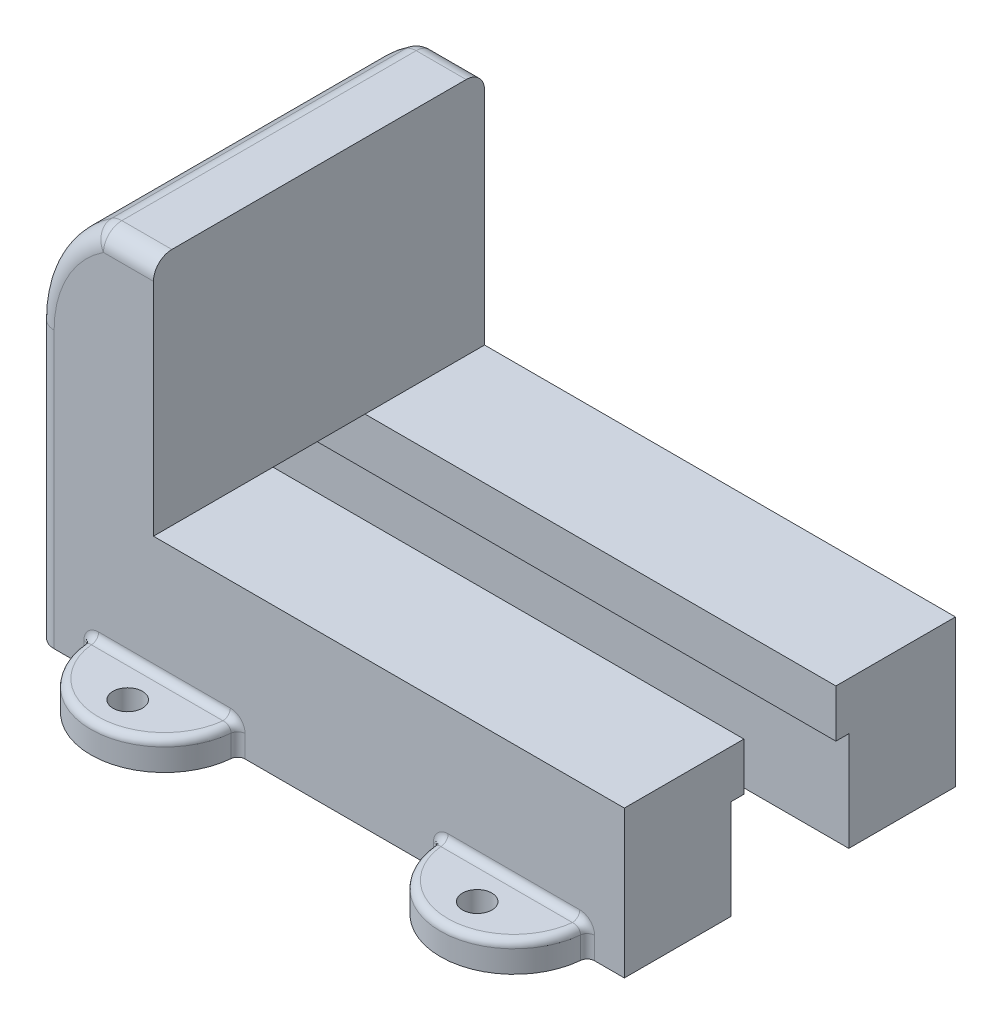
from build123d import *

# Parameters (mm, degrees)
SKETCH1_W                      = 185
SKETCH1_H                      = 40
EXTRUDE1_DEPTH                 = 45
EXTRUDE2_DEPTH                 = 90
EXTRUDE3_DEPTH                 = 25
CUT_EXTRUDE1_DEPTH             = 218.428149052
EXTRUDE4_DEPTH                 = 8
EXTRUDE5_DEPTH                 = 8
F_8_0_8_DIAMETER_HOLE1_D       = 8
F_14_0_14_DIAMETER_HOLE1_D     = 14
F_14_0_14_DIAMETER_HOLE1_DEPTH = 25
FILLET1_R                      = 2
FILLET2_R                      = 2
FILLET3_R                      = 2
FILLET10_R                     = 5
CUT_EXTRUDE2_DEPTH             = 240.478600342
CUT_EXTRUDE2_DEPTH_BACK        = 240.478600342


with BuildPart() as part:
    # Sketch1 → Extrude1 (new, symmetric)
    with BuildSketch(Plane.XY):
        with Locations((92.5, 20)):
            Rectangle(SKETCH1_W, SKETCH1_H)
    extrude(amount=EXTRUDE1_DEPTH, both=True)

    # Sketch2 → Extrude2 (add)
    with BuildSketch(Plane.XY.offset(45)):
        with BuildLine():
            Line((0, 40), (32, 40))
            Line((32, 40), (32, 105))
            Line((32, 105), (16.972243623, 105))
            ThreePointArc((16.972243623, 105), (4.537141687, 92.234101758), (0, 75))
            Line((0, 75), (0, 40))
        make_face()
    extrude(amount=-EXTRUDE2_DEPTH)

    # Sketch3 → Extrude3 (add)
    with BuildSketch(Plane(origin=(185, 0, 0), x_dir=(0, 0, -1), z_dir=(1, 0, 0))):
        with BuildLine():
            Line((-45, 40), (45, 40))
            Line((45, 40), (45, 55))
            Line((45, 55), (17, 55))
            ThreePointArc((17, 55), (0, 72), (-17, 55))
            Line((-17, 55), (-45, 55))
            Line((-45, 55), (-45, 40))
        make_face()
    extrude(amount=-EXTRUDE3_DEPTH)

    # Sketch4 → Cut-Extrude1 (cut, through all)
    with BuildSketch(Plane(origin=(185, 0, 0), x_dir=(0, 0, -1), z_dir=(1, 0, 0))):
        Polygon((-16, 0), (16, 0), (16, 27), (12.5, 27), (12.5, 40), (-12.5, 40), (-12.5, 27), (-16, 27), align=None)
    extrude(amount=-CUT_EXTRUDE1_DEPTH, mode=Mode.SUBTRACT)

    # Sketch5 → Extrude4 (add)
    with BuildSketch(Plane.XZ):
        with BuildLine():
            Line((15, 45), (55, 45))
            ThreePointArc((55, 45), (35, 65), (15, 45))
        make_face()
    extrude4 = extrude(amount=-EXTRUDE4_DEPTH)

    # Sketch6 → Extrude5 (add)
    with BuildSketch(Plane.XZ):
        with BuildLine():
            Line((110, 45), (150, 45))
            ThreePointArc((150, 45), (130, 65), (110, 45))
        make_face()
    extrude5 = extrude(amount=-EXTRUDE5_DEPTH)

    # Mirror1: Extrude4, Extrude5 across plane
    add(extrude4.mirror(Plane.XY))
    add(extrude5.mirror(Plane.XY))

    # 8.0 _8_ Diameter Hole1 (through all)
    with Locations(Plane(origin=(0, 8, 0), x_dir=(-1, 0, 0), z_dir=(0, 1, 0))):
        with Locations((-35, 55), (-130, 55), (-35, -55), (-130, -55)):
            Hole(F_8_0_8_DIAMETER_HOLE1_D / 2)

    # 14.0 _14_ Diameter Hole1
    with Locations(Plane(origin=(185, 0, 0), x_dir=(0, 0, -1), z_dir=(1, 0, 0))):
        with Locations((0, 55)):
            Hole(F_14_0_14_DIAMETER_HOLE1_D / 2, depth=F_14_0_14_DIAMETER_HOLE1_DEPTH)

    # Fillet1
    fillet1_edges = [part.edges().sort_by_distance(p)[0] for p in [
        (35, 8, -65),
        (130, 8, -65),
        (35, 8, 65),
        (130, 8, 65),
    ]]
    fillet(fillet1_edges, radius=FILLET1_R)

    # Fillet2
    fillet2_edges = [part.edges().sort_by_distance(p)[0] for p in [
        (130, 8, -45),
        (150, 3, -45),
        (110, 3, -45),
        (35, 8, -45),
        (15, 3, -45),
        (55, 3, -45),
        (150, 3, 45),
        (110, 3, 45),
        (130, 8, 45),
        (55, 3, 45),
        (15, 3, 45),
        (35, 8, 45),
        (110.585786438, 7.414213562, -45),
        (149.414213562, 7.414213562, -45),
        (15.585786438, 7.414213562, -45),
        (54.414213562, 7.414213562, -45),
        (110.585786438, 7.414213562, 45),
        (149.414213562, 7.414213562, 45),
        (15.585786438, 7.414213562, 45),
        (54.414213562, 7.414213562, 45),
        (172.5, 55, 45),
        (172.5, 55, 17),
        (172.5, 55, -17),
        (172.5, 55, -45),
    ]]
    fillet(fillet2_edges, radius=FILLET2_R)

    # Fillet3
    fillet3_edges = [part.edges().sort_by_distance(p)[0] for p in [
        (185, 26.5, 45),
        (185, 55, 30.947221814),
        (185, 55, -30.947221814),
        (185, 72, 0),
        (185, 54.414213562, -44.414213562),
        (185, 54.414213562, 44.414213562),
        (185, 55.513216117, -17.55673152),
        (185, 55.513216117, 17.55673152),
        (185, 26.5, -45),
    ]]
    fillet(fillet3_edges, radius=FILLET3_R)

    # Fillet10
    fillet10_edges = [part.edges().sort_by_distance(p)[0] for p in [
        (4.537141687, 92.234101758, -45),
        (24.486121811, 105, -45),
        (16.972243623, 105, 0),
        (24.486121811, 105, 45),
        (4.537141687, 92.234101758, 45),
        (0, 37.5, 45),
        (0, 37.5, -45),
    ]]
    fillet(fillet10_edges, radius=FILLET10_R)

    # Sketch12 → Cut-Extrude2 (cut, two sides: drawn at the far end of the back side and taken through both)
    with BuildSketch(Plane.XY.offset(45).offset(-CUT_EXTRUDE2_DEPTH_BACK)):
        Polygon((160, 498.798215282), (160, 86.777149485), (160, -16.676761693), (160, -428.69782749), (984.042131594, -428.69782749), (984.042131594, 498.798215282), align=None)
    extrude(amount=CUT_EXTRUDE2_DEPTH + CUT_EXTRUDE2_DEPTH_BACK, mode=Mode.SUBTRACT)


solid = part.part
